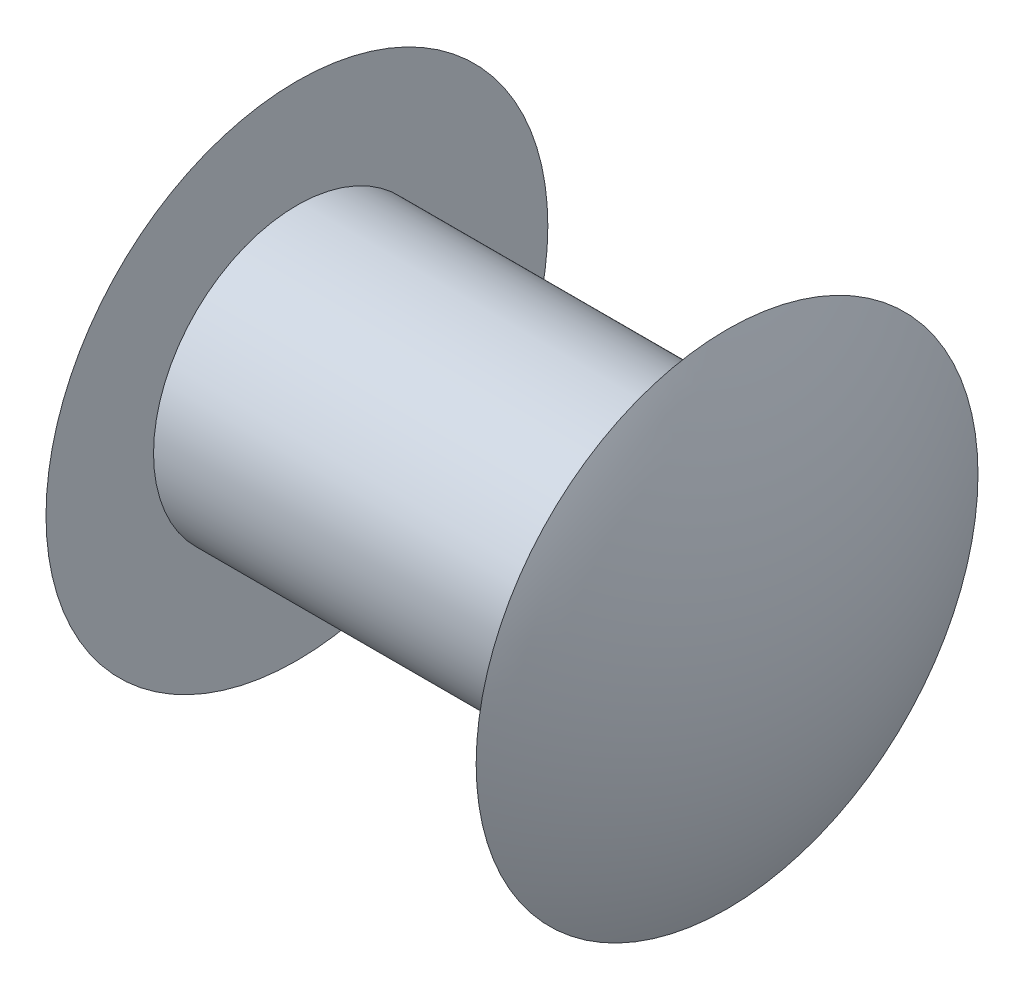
ISO-10303-21;
HEADER;
FILE_DESCRIPTION(('STEP AP214'),'2;1');
FILE_NAME('part.step','',(''),(''),'','','');
FILE_SCHEMA(('AUTOMOTIVE_DESIGN { 1 0 10303 214 1 1 1 1 }'));
ENDSEC;
DATA;
#1=APPLICATION_CONTEXT('core data for automotive mechanical design processes');
#2=APPLICATION_PROTOCOL_DEFINITION('international standard','automotive_design',2000,#1);
#3=PRODUCT_CONTEXT('',#1,'mechanical');
#4=PRODUCT('Part','Part','',(#3));
#5=PRODUCT_RELATED_PRODUCT_CATEGORY('part','',(#4));
#6=PRODUCT_DEFINITION_FORMATION('','',#4);
#7=PRODUCT_DEFINITION_CONTEXT('part definition',#1,'design');
#8=PRODUCT_DEFINITION('design','',#6,#7);
#9=PRODUCT_DEFINITION_SHAPE('','',#8);
#10=(LENGTH_UNIT() NAMED_UNIT(*) SI_UNIT(.MILLI.,.METRE.));
#11=(NAMED_UNIT(*) PLANE_ANGLE_UNIT() SI_UNIT($,.RADIAN.));
#12=(NAMED_UNIT(*) SI_UNIT($,.STERADIAN.) SOLID_ANGLE_UNIT());
#13=UNCERTAINTY_MEASURE_WITH_UNIT(LENGTH_MEASURE(1.E-05),#10,'distance_accuracy_value','');
#14=(GEOMETRIC_REPRESENTATION_CONTEXT(3) GLOBAL_UNCERTAINTY_ASSIGNED_CONTEXT((#13)) GLOBAL_UNIT_ASSIGNED_CONTEXT((#10,
#11,#12)) REPRESENTATION_CONTEXT('',''));
#15=CARTESIAN_POINT('',(0.,0.,0.));
#16=DIRECTION('',(0.,0.,1.));
#17=DIRECTION('',(1.,0.,0.));
#18=AXIS2_PLACEMENT_3D('',#15,#16,#17);
#19=CARTESIAN_POINT('',(0.,5.55625,0.));
#20=DIRECTION('',(-1.,0.,0.));
#21=DIRECTION('',(0.,0.,1.));
#22=AXIS2_PLACEMENT_3D('',#19,#20,#21);
#23=PLANE('',#22);
#24=CARTESIAN_POINT('',(0.,0.,0.));
#25=DIRECTION('',(-1.,0.,0.));
#26=DIRECTION('',(0.,0.,1.));
#27=AXIS2_PLACEMENT_3D('',#24,#25,#26);
#28=CIRCLE('',#27,5.55625);
#29=CARTESIAN_POINT('',(0.,0.,5.55625));
#30=VERTEX_POINT('',#29);
#31=EDGE_CURVE('E38',#30,#30,#28,.T.);
#32=ORIENTED_EDGE('',*,*,#31,.F.);
#33=EDGE_LOOP('',(#32));
#34=FACE_BOUND('',#33,.T.);
#35=CARTESIAN_POINT('',(0.,0.,0.));
#36=DIRECTION('',(-1.,0.,0.));
#37=DIRECTION('',(0.,0.,1.));
#38=AXIS2_PLACEMENT_3D('',#35,#36,#37);
#39=CIRCLE('',#38,3.175);
#40=CARTESIAN_POINT('',(0.,0.,3.175));
#41=VERTEX_POINT('',#40);
#42=EDGE_CURVE('E10',#41,#41,#39,.T.);
#43=ORIENTED_EDGE('',*,*,#42,.T.);
#44=EDGE_LOOP('',(#43));
#45=FACE_BOUND('',#44,.T.);
#46=ADVANCED_FACE('F24',(#34,#45),#23,.F.);
#47=CARTESIAN_POINT('',(-1.27,0.,0.));
#48=DIRECTION('',(-1.,0.,0.));
#49=DIRECTION('',(0.,0.,1.));
#50=AXIS2_PLACEMENT_3D('',#47,#48,#49);
#51=CYLINDRICAL_SURFACE('',#50,3.175);
#52=ORIENTED_EDGE('',*,*,#42,.F.);
#53=EDGE_LOOP('',(#52));
#54=FACE_BOUND('',#53,.T.);
#55=CARTESIAN_POINT('',(9.525,0.,0.));
#56=DIRECTION('',(-1.,0.,0.));
#57=DIRECTION('',(0.,0.,1.));
#58=AXIS2_PLACEMENT_3D('',#55,#56,#57);
#59=CIRCLE('',#58,3.175);
#60=CARTESIAN_POINT('',(9.525,0.,3.175));
#61=VERTEX_POINT('',#60);
#62=EDGE_CURVE('E30',#61,#61,#59,.T.);
#63=ORIENTED_EDGE('',*,*,#62,.T.);
#64=EDGE_LOOP('',(#63));
#65=FACE_BOUND('',#64,.T.);
#66=ADVANCED_FACE('F47',(#54,#65),#51,.T.);
#67=CARTESIAN_POINT('',(9.525,5.55625,0.));
#68=DIRECTION('',(1.,0.,0.));
#69=DIRECTION('',(0.,0.,-1.));
#70=AXIS2_PLACEMENT_3D('',#67,#68,#69);
#71=PLANE('',#70);
#72=ORIENTED_EDGE('',*,*,#62,.F.);
#73=EDGE_LOOP('',(#72));
#74=FACE_BOUND('',#73,.T.);
#75=CARTESIAN_POINT('',(9.525,0.,0.));
#76=DIRECTION('',(-1.,0.,0.));
#77=DIRECTION('',(0.,0.,1.));
#78=AXIS2_PLACEMENT_3D('',#75,#76,#77);
#79=CIRCLE('',#78,5.55625);
#80=CARTESIAN_POINT('',(9.525,0.,5.55625));
#81=VERTEX_POINT('',#80);
#82=EDGE_CURVE('E34',#81,#81,#79,.T.);
#83=ORIENTED_EDGE('',*,*,#82,.T.);
#84=EDGE_LOOP('',(#83));
#85=FACE_BOUND('',#84,.T.);
#86=ADVANCED_FACE('F51',(#74,#85),#71,.F.);
#87=CARTESIAN_POINT('',(-1.994296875,0.,0.));
#88=DIRECTION('',(-1.,0.,0.));
#89=DIRECTION('',(0.,1.,0.));
#90=AXIS2_PLACEMENT_3D('',#87,#88,#89);
#91=SPHERICAL_SURFACE('',#90,12.789296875);
#92=ORIENTED_EDGE('',*,*,#82,.F.);
#93=EDGE_LOOP('',(#92));
#94=FACE_BOUND('',#93,.T.);
#95=ADVANCED_FACE('F56',(#94),#91,.T.);
#96=CARTESIAN_POINT('',(11.519296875,0.,0.));
#97=DIRECTION('',(-1.,0.,0.));
#98=DIRECTION('',(0.,1.,0.));
#99=AXIS2_PLACEMENT_3D('',#96,#97,#98);
#100=SPHERICAL_SURFACE('',#99,12.789296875);
#101=ORIENTED_EDGE('',*,*,#31,.T.);
#102=EDGE_LOOP('',(#101));
#103=FACE_BOUND('',#102,.T.);
#104=ADVANCED_FACE('F44',(#103),#100,.T.);
#105=CLOSED_SHELL('',(#46,#66,#86,#95,#104));
#106=MANIFOLD_SOLID_BREP('B2',#105);
#107=ADVANCED_BREP_SHAPE_REPRESENTATION('',(#18,#106),#14);
#108=SHAPE_DEFINITION_REPRESENTATION(#9,#107);
ENDSEC;
END-ISO-10303-21;
